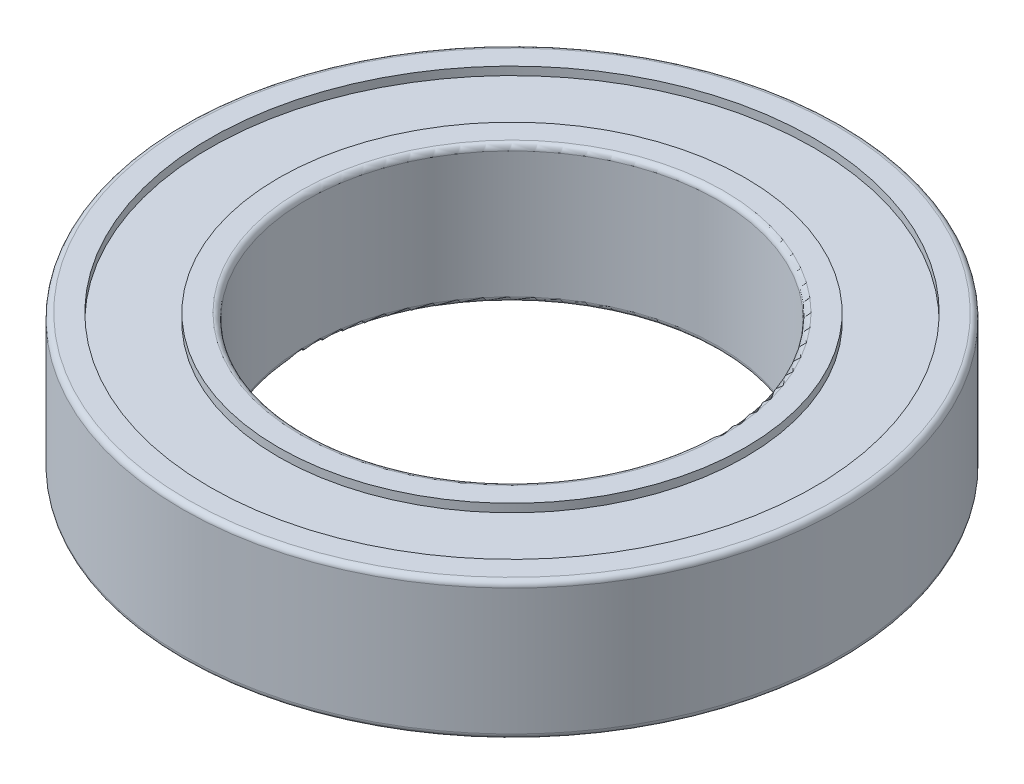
ISO-10303-21;
HEADER;
FILE_DESCRIPTION(('STEP AP214'),'2;1');
FILE_NAME('part.step','',(''),(''),'','','');
FILE_SCHEMA(('AUTOMOTIVE_DESIGN { 1 0 10303 214 1 1 1 1 }'));
ENDSEC;
DATA;
#1=APPLICATION_CONTEXT('core data for automotive mechanical design processes');
#2=APPLICATION_PROTOCOL_DEFINITION('international standard','automotive_design',2000,#1);
#3=PRODUCT_CONTEXT('',#1,'mechanical');
#4=PRODUCT('Part','Part','',(#3));
#5=PRODUCT_RELATED_PRODUCT_CATEGORY('part','',(#4));
#6=PRODUCT_DEFINITION_FORMATION('','',#4);
#7=PRODUCT_DEFINITION_CONTEXT('part definition',#1,'design');
#8=PRODUCT_DEFINITION('design','',#6,#7);
#9=PRODUCT_DEFINITION_SHAPE('','',#8);
#10=(LENGTH_UNIT() NAMED_UNIT(*) SI_UNIT(.MILLI.,.METRE.));
#11=(NAMED_UNIT(*) PLANE_ANGLE_UNIT() SI_UNIT($,.RADIAN.));
#12=(NAMED_UNIT(*) SI_UNIT($,.STERADIAN.) SOLID_ANGLE_UNIT());
#13=UNCERTAINTY_MEASURE_WITH_UNIT(LENGTH_MEASURE(1.E-05),#10,'distance_accuracy_value','');
#14=(GEOMETRIC_REPRESENTATION_CONTEXT(3) GLOBAL_UNCERTAINTY_ASSIGNED_CONTEXT((#13)) GLOBAL_UNIT_ASSIGNED_CONTEXT((#10,
#11,#12)) REPRESENTATION_CONTEXT('',''));
#15=CARTESIAN_POINT('',(0.,0.,0.));
#16=DIRECTION('',(0.,0.,1.));
#17=DIRECTION('',(1.,0.,0.));
#18=AXIS2_PLACEMENT_3D('',#15,#16,#17);
#19=CARTESIAN_POINT('',(0.,-2.75,0.));
#20=DIRECTION('',(0.,1.,0.));
#21=DIRECTION('',(0.,0.,1.));
#22=AXIS2_PLACEMENT_3D('',#19,#20,#21);
#23=CYLINDRICAL_SURFACE('',#22,7.5);
#24=CARTESIAN_POINT('',(0.,2.3,0.));
#25=DIRECTION('',(0.,1.,0.));
#26=DIRECTION('',(0.,0.,-1.));
#27=AXIS2_PLACEMENT_3D('',#24,#25,#26);
#28=CIRCLE('',#27,7.5);
#29=CARTESIAN_POINT('',(0.,2.3,-7.5));
#30=VERTEX_POINT('',#29);
#31=EDGE_CURVE('E60',#30,#30,#28,.F.);
#32=ORIENTED_EDGE('',*,*,#31,.F.);
#33=EDGE_LOOP('',(#32));
#34=FACE_BOUND('',#33,.T.);
#35=CARTESIAN_POINT('',(0.,-2.3,0.));
#36=DIRECTION('',(0.,1.,0.));
#37=DIRECTION('',(0.,0.,-1.));
#38=AXIS2_PLACEMENT_3D('',#35,#36,#37);
#39=CIRCLE('',#38,7.5);
#40=CARTESIAN_POINT('',(0.,-2.3,-7.5));
#41=VERTEX_POINT('',#40);
#42=EDGE_CURVE('E261',#41,#41,#39,.T.);
#43=ORIENTED_EDGE('',*,*,#42,.F.);
#44=EDGE_LOOP('',(#43));
#45=FACE_BOUND('',#44,.T.);
#46=ADVANCED_FACE('F16',(#34,#45),#23,.F.);
#47=CARTESIAN_POINT('',(0.,-2.3,0.));
#48=DIRECTION('',(0.,1.,0.));
#49=DIRECTION('',(0.,0.,-1.));
#50=AXIS2_PLACEMENT_3D('',#47,#48,#49);
#51=TOROIDAL_SURFACE('',#50,7.7,0.2);
#52=CARTESIAN_POINT('',(0.,-2.5,0.));
#53=DIRECTION('',(0.,-1.,0.));
#54=DIRECTION('',(0.,0.,-1.));
#55=AXIS2_PLACEMENT_3D('',#52,#53,#54);
#56=CIRCLE('',#55,7.7);
#57=CARTESIAN_POINT('',(0.,-2.5,-7.7));
#58=VERTEX_POINT('',#57);
#59=CARTESIAN_POINT('',(0.,-2.5,7.7));
#60=VERTEX_POINT('',#59);
#61=EDGE_CURVE('E55',#58,#60,#56,.T.);
#62=ORIENTED_EDGE('',*,*,#61,.T.);
#63=CARTESIAN_POINT('',(0.,-2.5,0.));
#64=DIRECTION('',(0.,-1.,0.));
#65=DIRECTION('',(0.,0.,1.));
#66=AXIS2_PLACEMENT_3D('',#63,#64,#65);
#67=CIRCLE('',#66,7.7);
#68=EDGE_CURVE('E52',#60,#58,#67,.T.);
#69=ORIENTED_EDGE('',*,*,#68,.T.);
#70=EDGE_LOOP('',(#62,#69));
#71=FACE_BOUND('',#70,.T.);
#72=ORIENTED_EDGE('',*,*,#42,.T.);
#73=EDGE_LOOP('',(#72));
#74=FACE_BOUND('',#73,.T.);
#75=ADVANCED_FACE('F56',(#71,#74),#51,.T.);
#76=CARTESIAN_POINT('',(0.,2.3,0.));
#77=DIRECTION('',(0.,1.,0.));
#78=DIRECTION('',(0.,0.,-1.));
#79=AXIS2_PLACEMENT_3D('',#76,#77,#78);
#80=TOROIDAL_SURFACE('',#79,7.7,0.2);
#81=ORIENTED_EDGE('',*,*,#31,.T.);
#82=EDGE_LOOP('',(#81));
#83=FACE_BOUND('',#82,.T.);
#84=CARTESIAN_POINT('',(0.,2.5,0.));
#85=DIRECTION('',(0.,1.,0.));
#86=DIRECTION('',(0.,0.,-1.));
#87=AXIS2_PLACEMENT_3D('',#84,#85,#86);
#88=CIRCLE('',#87,7.7);
#89=CARTESIAN_POINT('',(0.,2.5,7.7));
#90=VERTEX_POINT('',#89);
#91=CARTESIAN_POINT('',(0.,2.5,-7.7));
#92=VERTEX_POINT('',#91);
#93=EDGE_CURVE('E223',#90,#92,#88,.F.);
#94=ORIENTED_EDGE('',*,*,#93,.F.);
#95=CARTESIAN_POINT('',(0.,2.5,0.));
#96=DIRECTION('',(0.,1.,0.));
#97=DIRECTION('',(0.,0.,1.));
#98=AXIS2_PLACEMENT_3D('',#95,#96,#97);
#99=CIRCLE('',#98,7.7);
#100=EDGE_CURVE('E65',#92,#90,#99,.F.);
#101=ORIENTED_EDGE('',*,*,#100,.F.);
#102=EDGE_LOOP('',(#94,#101));
#103=FACE_BOUND('',#102,.T.);
#104=ADVANCED_FACE('F86',(#83,#103),#80,.T.);
#105=CARTESIAN_POINT('',(0.,-2.5,0.));
#106=DIRECTION('',(0.,1.,0.));
#107=DIRECTION('',(0.,0.,1.));
#108=AXIS2_PLACEMENT_3D('',#105,#106,#107);
#109=PLANE('',#108);
#110=ORIENTED_EDGE('',*,*,#61,.F.);
#111=ORIENTED_EDGE('',*,*,#68,.F.);
#112=EDGE_LOOP('',(#110,#111));
#113=FACE_BOUND('',#112,.T.);
#114=CARTESIAN_POINT('',(0.,-2.5,0.));
#115=DIRECTION('',(0.,1.,0.));
#116=DIRECTION('',(0.,0.,1.));
#117=AXIS2_PLACEMENT_3D('',#114,#115,#116);
#118=CIRCLE('',#117,8.5);
#119=CARTESIAN_POINT('',(0.,-2.5,8.5));
#120=VERTEX_POINT('',#119);
#121=EDGE_CURVE('E232',#120,#120,#118,.T.);
#122=ORIENTED_EDGE('',*,*,#121,.F.);
#123=EDGE_LOOP('',(#122));
#124=FACE_BOUND('',#123,.T.);
#125=ADVANCED_FACE('F63',(#113,#124),#109,.F.);
#126=CARTESIAN_POINT('',(0.,2.5,0.));
#127=DIRECTION('',(0.,1.,0.));
#128=DIRECTION('',(0.,0.,1.));
#129=AXIS2_PLACEMENT_3D('',#126,#127,#128);
#130=PLANE('',#129);
#131=ORIENTED_EDGE('',*,*,#100,.T.);
#132=ORIENTED_EDGE('',*,*,#93,.T.);
#133=EDGE_LOOP('',(#131,#132));
#134=FACE_BOUND('',#133,.T.);
#135=CARTESIAN_POINT('',(0.,2.5,0.));
#136=DIRECTION('',(0.,1.,0.));
#137=DIRECTION('',(0.,0.,1.));
#138=AXIS2_PLACEMENT_3D('',#135,#136,#137);
#139=CIRCLE('',#138,8.5);
#140=CARTESIAN_POINT('',(0.,2.5,8.5));
#141=VERTEX_POINT('',#140);
#142=EDGE_CURVE('E234',#141,#141,#139,.F.);
#143=ORIENTED_EDGE('',*,*,#142,.F.);
#144=EDGE_LOOP('',(#143));
#145=FACE_BOUND('',#144,.T.);
#146=ADVANCED_FACE('F85',(#134,#145),#130,.T.);
#147=CARTESIAN_POINT('',(0.,-2.75,0.));
#148=DIRECTION('',(0.,1.,0.));
#149=DIRECTION('',(0.,0.,1.));
#150=AXIS2_PLACEMENT_3D('',#147,#148,#149);
#151=CYLINDRICAL_SURFACE('',#150,8.5);
#152=ORIENTED_EDGE('',*,*,#121,.T.);
#153=EDGE_LOOP('',(#152));
#154=FACE_BOUND('',#153,.T.);
#155=CARTESIAN_POINT('',(0.,-2.2,0.));
#156=DIRECTION('',(0.,1.,0.));
#157=DIRECTION('',(0.,0.,1.));
#158=AXIS2_PLACEMENT_3D('',#155,#156,#157);
#159=CIRCLE('',#158,8.5);
#160=CARTESIAN_POINT('',(0.,-2.2,8.5));
#161=VERTEX_POINT('',#160);
#162=EDGE_CURVE('E239',#161,#161,#159,.F.);
#163=ORIENTED_EDGE('',*,*,#162,.T.);
#164=EDGE_LOOP('',(#163));
#165=FACE_BOUND('',#164,.T.);
#166=ADVANCED_FACE('F274',(#154,#165),#151,.T.);
#167=CARTESIAN_POINT('',(0.,-2.75,0.));
#168=DIRECTION('',(0.,1.,0.));
#169=DIRECTION('',(0.,0.,1.));
#170=AXIS2_PLACEMENT_3D('',#167,#168,#169);
#171=CYLINDRICAL_SURFACE('',#170,8.5);
#172=CARTESIAN_POINT('',(0.,2.2,0.));
#173=DIRECTION('',(0.,1.,0.));
#174=DIRECTION('',(0.,0.,1.));
#175=AXIS2_PLACEMENT_3D('',#172,#173,#174);
#176=CIRCLE('',#175,8.5);
#177=CARTESIAN_POINT('',(0.,2.2,8.5));
#178=VERTEX_POINT('',#177);
#179=EDGE_CURVE('E269',#178,#178,#176,.F.);
#180=ORIENTED_EDGE('',*,*,#179,.F.);
#181=EDGE_LOOP('',(#180));
#182=FACE_BOUND('',#181,.T.);
#183=ORIENTED_EDGE('',*,*,#142,.T.);
#184=EDGE_LOOP('',(#183));
#185=FACE_BOUND('',#184,.T.);
#186=ADVANCED_FACE('F280',(#182,#185),#171,.T.);
#187=CARTESIAN_POINT('',(0.,-2.2,0.));
#188=DIRECTION('',(0.,1.,0.));
#189=DIRECTION('',(0.,0.,1.));
#190=AXIS2_PLACEMENT_3D('',#187,#188,#189);
#191=PLANE('',#190);
#192=ORIENTED_EDGE('',*,*,#162,.F.);
#193=EDGE_LOOP('',(#192));
#194=FACE_BOUND('',#193,.T.);
#195=CARTESIAN_POINT('',(0.,-2.2,0.));
#196=DIRECTION('',(0.,1.,0.));
#197=DIRECTION('',(0.,0.,1.));
#198=AXIS2_PLACEMENT_3D('',#195,#196,#197);
#199=CIRCLE('',#198,11.);
#200=CARTESIAN_POINT('',(0.,-2.2,11.));
#201=VERTEX_POINT('',#200);
#202=EDGE_CURVE('E266',#201,#201,#199,.F.);
#203=ORIENTED_EDGE('',*,*,#202,.T.);
#204=EDGE_LOOP('',(#203));
#205=FACE_BOUND('',#204,.T.);
#206=ADVANCED_FACE('F276',(#194,#205),#191,.F.);
#207=CARTESIAN_POINT('',(0.,2.2,0.));
#208=DIRECTION('',(0.,1.,0.));
#209=DIRECTION('',(0.,0.,1.));
#210=AXIS2_PLACEMENT_3D('',#207,#208,#209);
#211=PLANE('',#210);
#212=ORIENTED_EDGE('',*,*,#179,.T.);
#213=EDGE_LOOP('',(#212));
#214=FACE_BOUND('',#213,.T.);
#215=CARTESIAN_POINT('',(0.,2.2,0.));
#216=DIRECTION('',(0.,1.,0.));
#217=DIRECTION('',(0.,0.,1.));
#218=AXIS2_PLACEMENT_3D('',#215,#216,#217);
#219=CIRCLE('',#218,11.);
#220=CARTESIAN_POINT('',(0.,2.2,11.));
#221=VERTEX_POINT('',#220);
#222=EDGE_CURVE('E258',#221,#221,#219,.T.);
#223=ORIENTED_EDGE('',*,*,#222,.T.);
#224=EDGE_LOOP('',(#223));
#225=FACE_BOUND('',#224,.T.);
#226=ADVANCED_FACE('F279',(#214,#225),#211,.T.);
#227=CARTESIAN_POINT('',(0.,-2.75,0.));
#228=DIRECTION('',(0.,1.,0.));
#229=DIRECTION('',(0.,0.,1.));
#230=AXIS2_PLACEMENT_3D('',#227,#228,#229);
#231=CYLINDRICAL_SURFACE('',#230,11.);
#232=ORIENTED_EDGE('',*,*,#202,.F.);
#233=EDGE_LOOP('',(#232));
#234=FACE_BOUND('',#233,.T.);
#235=CARTESIAN_POINT('',(0.,-2.5,0.));
#236=DIRECTION('',(0.,1.,0.));
#237=DIRECTION('',(0.,0.,1.));
#238=AXIS2_PLACEMENT_3D('',#235,#236,#237);
#239=CIRCLE('',#238,11.);
#240=CARTESIAN_POINT('',(0.,-2.5,11.));
#241=VERTEX_POINT('',#240);
#242=EDGE_CURVE('E253',#241,#241,#239,.F.);
#243=ORIENTED_EDGE('',*,*,#242,.T.);
#244=EDGE_LOOP('',(#243));
#245=FACE_BOUND('',#244,.T.);
#246=ADVANCED_FACE('F284',(#234,#245),#231,.F.);
#247=CARTESIAN_POINT('',(0.,-2.75,0.));
#248=DIRECTION('',(0.,1.,0.));
#249=DIRECTION('',(0.,0.,1.));
#250=AXIS2_PLACEMENT_3D('',#247,#248,#249);
#251=CYLINDRICAL_SURFACE('',#250,11.);
#252=CARTESIAN_POINT('',(0.,2.5,0.));
#253=DIRECTION('',(0.,1.,0.));
#254=DIRECTION('',(0.,0.,1.));
#255=AXIS2_PLACEMENT_3D('',#252,#253,#254);
#256=CIRCLE('',#255,11.);
#257=CARTESIAN_POINT('',(0.,2.5,11.));
#258=VERTEX_POINT('',#257);
#259=EDGE_CURVE('E251',#258,#258,#256,.F.);
#260=ORIENTED_EDGE('',*,*,#259,.F.);
#261=EDGE_LOOP('',(#260));
#262=FACE_BOUND('',#261,.T.);
#263=ORIENTED_EDGE('',*,*,#222,.F.);
#264=EDGE_LOOP('',(#263));
#265=FACE_BOUND('',#264,.T.);
#266=ADVANCED_FACE('F188',(#262,#265),#251,.F.);
#267=CARTESIAN_POINT('',(0.,-2.5,0.));
#268=DIRECTION('',(0.,1.,0.));
#269=DIRECTION('',(0.,0.,1.));
#270=AXIS2_PLACEMENT_3D('',#267,#268,#269);
#271=PLANE('',#270);
#272=ORIENTED_EDGE('',*,*,#242,.F.);
#273=EDGE_LOOP('',(#272));
#274=FACE_BOUND('',#273,.T.);
#275=CARTESIAN_POINT('',(0.,-2.5,0.));
#276=DIRECTION('',(0.,1.,0.));
#277=DIRECTION('',(0.,0.,-1.));
#278=AXIS2_PLACEMENT_3D('',#275,#276,#277);
#279=CIRCLE('',#278,11.8);
#280=CARTESIAN_POINT('',(0.,-2.5,-11.8));
#281=VERTEX_POINT('',#280);
#282=CARTESIAN_POINT('',(0.,-2.5,11.8));
#283=VERTEX_POINT('',#282);
#284=EDGE_CURVE('E173',#281,#283,#279,.T.);
#285=ORIENTED_EDGE('',*,*,#284,.F.);
#286=CARTESIAN_POINT('',(0.,-2.5,0.));
#287=DIRECTION('',(0.,1.,0.));
#288=DIRECTION('',(0.,0.,1.));
#289=AXIS2_PLACEMENT_3D('',#286,#287,#288);
#290=CIRCLE('',#289,11.8);
#291=EDGE_CURVE('E201',#283,#281,#290,.T.);
#292=ORIENTED_EDGE('',*,*,#291,.F.);
#293=EDGE_LOOP('',(#285,#292));
#294=FACE_BOUND('',#293,.T.);
#295=ADVANCED_FACE('F179',(#274,#294),#271,.F.);
#296=CARTESIAN_POINT('',(0.,2.5,0.));
#297=DIRECTION('',(0.,1.,0.));
#298=DIRECTION('',(0.,0.,1.));
#299=AXIS2_PLACEMENT_3D('',#296,#297,#298);
#300=PLANE('',#299);
#301=ORIENTED_EDGE('',*,*,#259,.T.);
#302=EDGE_LOOP('',(#301));
#303=FACE_BOUND('',#302,.T.);
#304=CARTESIAN_POINT('',(0.,2.5,0.));
#305=DIRECTION('',(0.,-1.,0.));
#306=DIRECTION('',(0.,0.,1.));
#307=AXIS2_PLACEMENT_3D('',#304,#305,#306);
#308=CIRCLE('',#307,11.8);
#309=CARTESIAN_POINT('',(0.,2.5,11.8));
#310=VERTEX_POINT('',#309);
#311=CARTESIAN_POINT('',(0.,2.5,-11.8));
#312=VERTEX_POINT('',#311);
#313=EDGE_CURVE('E34',#310,#312,#308,.T.);
#314=ORIENTED_EDGE('',*,*,#313,.F.);
#315=CARTESIAN_POINT('',(0.,2.5,0.));
#316=DIRECTION('',(0.,-1.,0.));
#317=DIRECTION('',(0.,0.,-1.));
#318=AXIS2_PLACEMENT_3D('',#315,#316,#317);
#319=CIRCLE('',#318,11.8);
#320=EDGE_CURVE('E150',#312,#310,#319,.T.);
#321=ORIENTED_EDGE('',*,*,#320,.F.);
#322=EDGE_LOOP('',(#314,#321));
#323=FACE_BOUND('',#322,.T.);
#324=ADVANCED_FACE('F129',(#303,#323),#300,.T.);
#325=CARTESIAN_POINT('',(0.,-2.3,0.));
#326=DIRECTION('',(0.,1.,0.));
#327=DIRECTION('',(0.,0.,-1.));
#328=AXIS2_PLACEMENT_3D('',#325,#326,#327);
#329=TOROIDAL_SURFACE('',#328,11.8,0.2);
#330=CARTESIAN_POINT('',(0.,-2.3,0.));
#331=DIRECTION('',(0.,1.,0.));
#332=DIRECTION('',(0.,0.,1.));
#333=AXIS2_PLACEMENT_3D('',#330,#331,#332);
#334=CIRCLE('',#333,12.);
#335=CARTESIAN_POINT('',(0.,-2.3,12.));
#336=VERTEX_POINT('',#335);
#337=EDGE_CURVE('E26',#336,#336,#334,.T.);
#338=ORIENTED_EDGE('',*,*,#337,.F.);
#339=EDGE_LOOP('',(#338));
#340=FACE_BOUND('',#339,.T.);
#341=ORIENTED_EDGE('',*,*,#291,.T.);
#342=ORIENTED_EDGE('',*,*,#284,.T.);
#343=EDGE_LOOP('',(#341,#342));
#344=FACE_BOUND('',#343,.T.);
#345=ADVANCED_FACE('F117',(#340,#344),#329,.T.);
#346=CARTESIAN_POINT('',(0.,2.3,0.));
#347=DIRECTION('',(0.,1.,0.));
#348=DIRECTION('',(0.,0.,-1.));
#349=AXIS2_PLACEMENT_3D('',#346,#347,#348);
#350=TOROIDAL_SURFACE('',#349,11.8,0.2);
#351=ORIENTED_EDGE('',*,*,#313,.T.);
#352=ORIENTED_EDGE('',*,*,#320,.T.);
#353=EDGE_LOOP('',(#351,#352));
#354=FACE_BOUND('',#353,.T.);
#355=CARTESIAN_POINT('',(0.,2.3,0.));
#356=DIRECTION('',(0.,1.,0.));
#357=DIRECTION('',(0.,0.,1.));
#358=AXIS2_PLACEMENT_3D('',#355,#356,#357);
#359=CIRCLE('',#358,12.);
#360=CARTESIAN_POINT('',(0.,2.3,12.));
#361=VERTEX_POINT('',#360);
#362=EDGE_CURVE('E11',#361,#361,#359,.F.);
#363=ORIENTED_EDGE('',*,*,#362,.F.);
#364=EDGE_LOOP('',(#363));
#365=FACE_BOUND('',#364,.T.);
#366=ADVANCED_FACE('F128',(#354,#365),#350,.T.);
#367=CARTESIAN_POINT('',(0.,-2.75,0.));
#368=DIRECTION('',(0.,1.,0.));
#369=DIRECTION('',(0.,0.,1.));
#370=AXIS2_PLACEMENT_3D('',#367,#368,#369);
#371=CYLINDRICAL_SURFACE('',#370,12.);
#372=ORIENTED_EDGE('',*,*,#362,.T.);
#373=EDGE_LOOP('',(#372));
#374=FACE_BOUND('',#373,.T.);
#375=ORIENTED_EDGE('',*,*,#337,.T.);
#376=EDGE_LOOP('',(#375));
#377=FACE_BOUND('',#376,.T.);
#378=ADVANCED_FACE('F296',(#374,#377),#371,.T.);
#379=CLOSED_SHELL('',(#46,#75,#104,#125,#146,#166,#186,#206,#226,#246,#266,#295,#324,#345,#366,#378));
#380=MANIFOLD_SOLID_BREP('B1',#379);
#381=ADVANCED_BREP_SHAPE_REPRESENTATION('',(#18,#380),#14);
#382=SHAPE_DEFINITION_REPRESENTATION(#9,#381);
ENDSEC;
END-ISO-10303-21;
